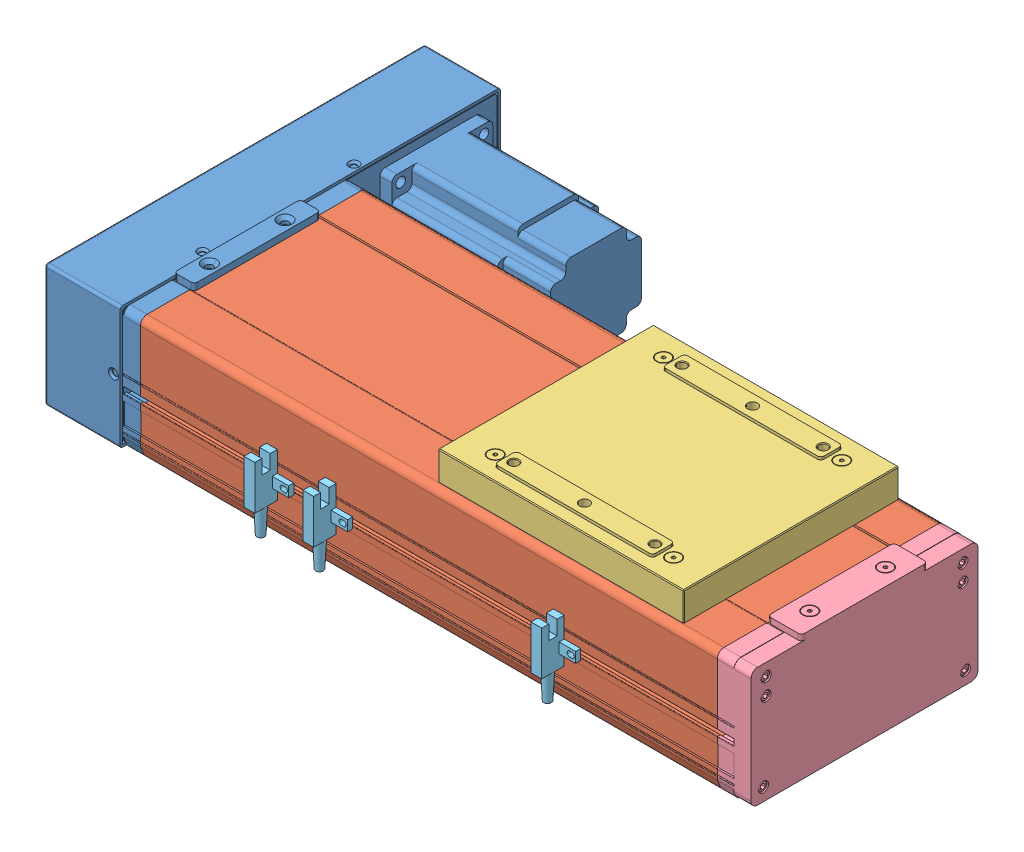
SolidWorks assembly TCD135-P-J4FL-0.SLDASM, configuration 150 (file format 9000). Lengths in mm.
Overall size (418.32 91 237.4).
7 component instances, 5 part files, 19 mates.
Components (placement in the parent):
- TCD135-P-J4FL-1-1: TCD135-P-J4FL-1.sldprt [默认] at (-347 36.4 -24.5) x (0 0 -1) z (1 0 0)
- TCD135-P-J4FL-4-1: TCD135-P-J4FL-4.SLDPRT [150] at (-325 1.5 0) x (0 0 -1) z (1 0 0) size (135 71.7 343)
- TCD135-P-J4FL-3-1: TCD135-P-J4FL-3.sldprt [默认] at (-78.5 35.4 0) x (0 0 -1) z (1 0 0)
- TCD135-P-J4FL-2-1: TCD135-P-J4FL-2.sldprt [默认] at (-307 -0.1 0)
- TCD135-P-J4FL-5-1: TCD135-P-J4FL-5.sldprt [默认] at (-103.3004 -3.7004 11) x (0 0 1) z (-1 0 0)
- TCD135-P-J4FL-5-2: TCD135-P-J4FL-5.sldprt [默认] at (67.2996 -3.7004 11) x (0 0 1) z (-1 0 0)
- TCD135-P-J4FL-5-3: TCD135-P-J4FL-5.sldprt [默认] at (-68.3004 -3.7004 11) x (0 0 1) z (-1 0 0)
Mates (geometry in assembly coordinates):
- 重合4: coincident anti-aligned: plane of TCD135-P-J4FL-4-1 through (18 67.6 63.5) normal (1 0 0); plane of TCD135-P-J4FL-2-1 through (18 35.75 0) normal (-1 0 0)
- 重合5: coincident aligned: plane of TCD135-P-J4FL-4-1 through (18 67.6 67.5) normal (0 0 1); plane of TCD135-P-J4FL-2-1 through (28 36 67.5) normal (0 0 1)
- 重合6: coincident aligned: plane of TCD135-P-J4FL-4-1 through (18 -0.1 65.16) normal (0 -1 0); plane of TCD135-P-J4FL-2-1 through (23 -0.1 49.63) normal (0 -1 0)
- 距离1: distance = 3.5 mm aligned: plane of TCD135-P-J4FL-3-1 through (-78.5 80.65 64) normal (0 0 1); plane of TCD135-P-J4FL-4-1 through (18 67.6 67.5) normal (0 0 1)
- 距离2: distance = 91 mm anti-aligned: plane of TCD135-P-J4FL-3-1 through (-78.5 90.9 50) normal (0 1 0); plane of TCD135-P-J4FL-4-1 through (18 -0.1 65.16) normal (0 -1 0)
- LimitDistance1: limit distance = 43.5 mm aligned: plane of TCD135-P-J4FL-3-1 through (-5.5 80.65 0) normal (1 0 0); plane of TCD135-P-J4FL-2-1 through (38 37.65 0) normal (1 0 0)
- LimitDistance2: limit distance = 228.5 mm aligned: plane of TCD135-P-J4FL-3-1 through (-151.5 80.65 0) normal (-1 0 0); plane of TCD135-P-J4FL-1-1 through (-380 36.9 -43.5) normal (-1 0 0)
- 重合7: coincident aligned: plane of TCD135-P-J4FL-4-1 through (18 67.6 67.5) normal (0 0 1); plane of TCD135-P-J4FL-1-1 through (-337.5 36.9 67.5) normal (0 0 1)
- 重合8: coincident aligned: plane of TCD135-P-J4FL-4-1 through (18 71.6 38.5) normal (0 1 0); plane of TCD135-P-J4FL-1-1 through (-330 71.6 51) normal (0 1 0)
- 重合9: coincident anti-aligned: plane of TCD135-P-J4FL-4-1 through (-325 67.6 63.5) normal (-1 0 0); plane of TCD135-P-J4FL-1-1 through (-325 35.75 0) normal (1 0 0)
- 重合10: coincident anti-aligned: plane of TCD135-P-J4FL-4-1 through (18 36.8953 67.5) normal (0 0 1); plane of TCD135-P-J4FL-5-1 through (-259.8 18.5 67.5) normal (0 0 -1)
- 重合11: coincident aligned: plane of TCD135-P-J4FL-4-1 through (18 27.7 65.8) normal (0 1 0); plane of TCD135-P-J4FL-5-1 through (-256.3367 27.7 67.5) normal (0 1 0)
- 重合12: coincident anti-aligned: plane of TCD135-P-J4FL-4-1 through (18 36.8953 67.5) normal (0 0 1); plane of TCD135-P-J4FL-5-2 through (-89.2 18.5 67.5) normal (0 0 -1)
- 重合13: coincident aligned: plane of TCD135-P-J4FL-4-1 through (18 27.7 65.8) normal (0 1 0); plane of TCD135-P-J4FL-5-2 through (-85.7367 27.7 67.5) normal (0 1 0)
- 重合14: coincident anti-aligned: plane of TCD135-P-J4FL-4-1 through (18 36.8953 67.5) normal (0 0 1); plane of TCD135-P-J4FL-5-3 through (-224.8 18.5 67.5) normal (0 0 -1)
- 重合15: coincident aligned: plane of TCD135-P-J4FL-4-1 through (18 27.7 65.8) normal (0 1 0); plane of TCD135-P-J4FL-5-3 through (-221.3367 27.7 67.5) normal (0 1 0)
- 距离3: distance = 35 mm aligned: plane of TCD135-P-J4FL-5-1 through (-250 18.5 67.5) normal (-1 0 0); plane of TCD135-P-J4FL-5-3 through (-215 18.5 67.5) normal (-1 0 0)
- 距离4: distance = 130 mm aligned: plane of TCD135-P-J4FL-1-1 through (-380 36.9 -43.5) normal (-1 0 0); plane of TCD135-P-J4FL-5-1 through (-250 18.5 67.5) normal (-1 0 0)
- 距离5: distance = 111 mm aligned: plane of TCD135-P-J4FL-5-2 through (-73 18.5 67.5) normal (1 0 0); plane of TCD135-P-J4FL-2-1 through (38 37.65 0) normal (1 0 0)
